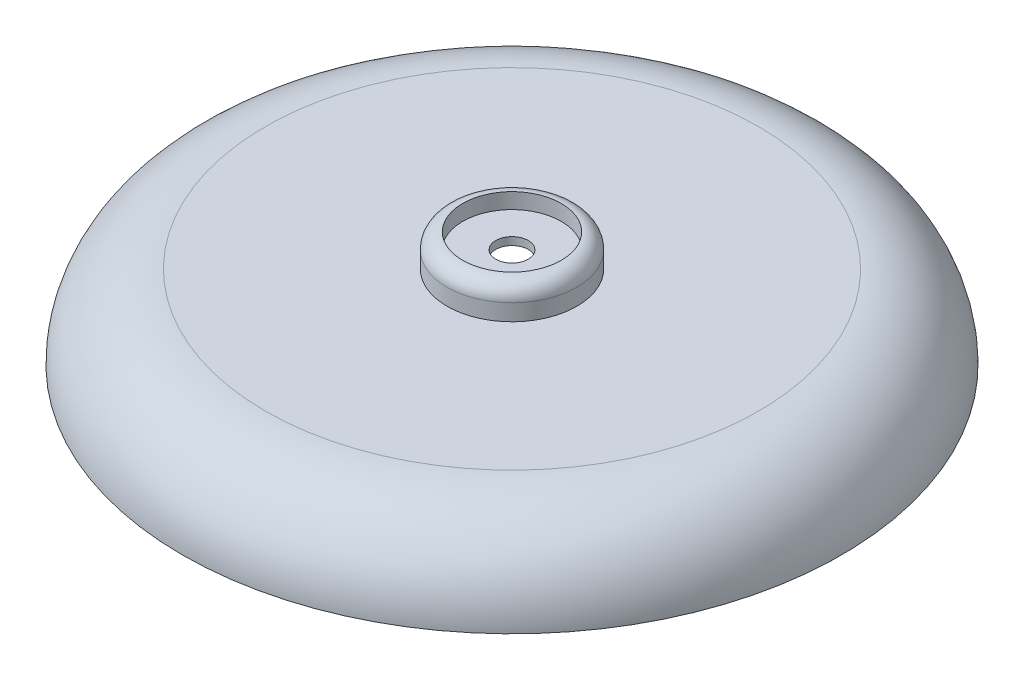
from build123d import *


with BuildPart() as part:
    # Sketch1 → Revolve1 (revolve)
    with BuildSketch(Plane.XY, mode=Mode.PRIVATE) as revolve1_sk:
        with BuildLine():
            Line((3.125, 0), (9.5, 0))
            Line((9.5, 0), (9.5, 3))
            ThreePointArc((9.5, 3), (11.621320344, 2.121320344), (12.5, 0))
            Line((12.5, 0), (12.5, -3.175))
            Line((12.5, -3.175), (47.5, -3.175))
            ThreePointArc((47.5, -3.175), (58.813708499, -7.861291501), (63.5, -19.175))
            Line((63.5, -19.175), (62, -19.175))
            ThreePointArc((62, -19.175), (57.753048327, -8.921951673), (47.5, -4.675))
            Line((47.5, -4.675), (11, -4.675))
            Line((11, -4.675), (11, -1.5))
            Line((11, -1.5), (3.125, -1.5))
            Line((3.125, -1.5), (3.125, 0))
        make_face()
    revolve(revolve1_sk.sketch.rotate(Axis((0, 0, 0), (0, 1, 0)), 90), axis=Axis((0, 0, 0), (0, 1, 0)))


solid = part.part
